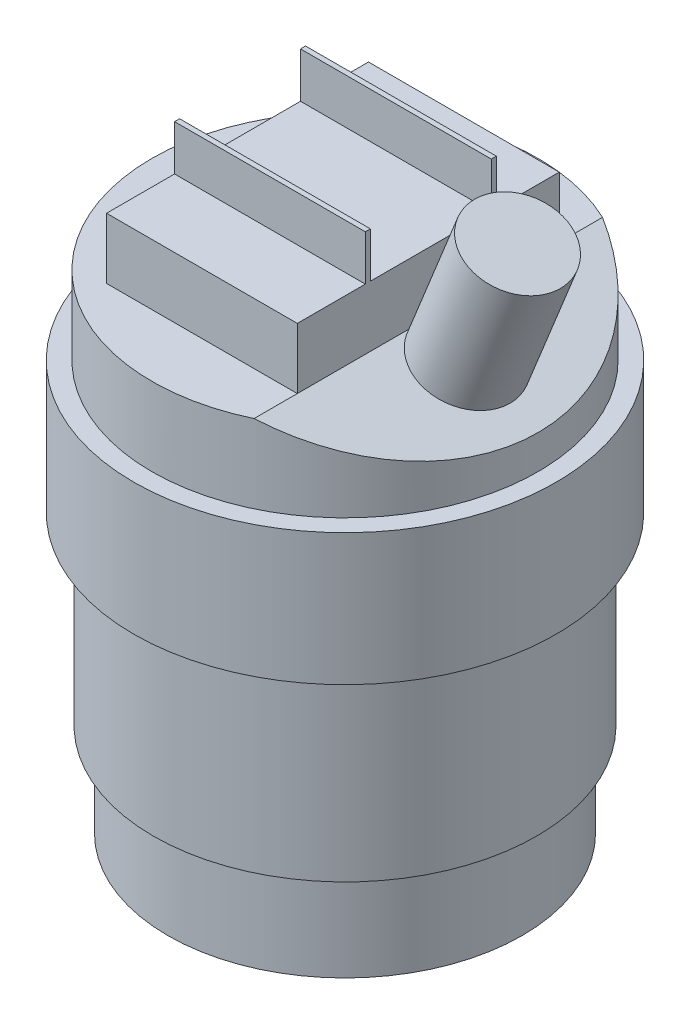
ISO-10303-21;
HEADER;
FILE_DESCRIPTION(('STEP AP214'),'2;1');
FILE_NAME('part.step','',(''),(''),'','','');
FILE_SCHEMA(('AUTOMOTIVE_DESIGN { 1 0 10303 214 1 1 1 1 }'));
ENDSEC;
DATA;
#1=APPLICATION_CONTEXT('core data for automotive mechanical design processes');
#2=APPLICATION_PROTOCOL_DEFINITION('international standard','automotive_design',2000,#1);
#3=PRODUCT_CONTEXT('',#1,'mechanical');
#4=PRODUCT('Part','Part','',(#3));
#5=PRODUCT_RELATED_PRODUCT_CATEGORY('part','',(#4));
#6=PRODUCT_DEFINITION_FORMATION('','',#4);
#7=PRODUCT_DEFINITION_CONTEXT('part definition',#1,'design');
#8=PRODUCT_DEFINITION('design','',#6,#7);
#9=PRODUCT_DEFINITION_SHAPE('','',#8);
#10=(LENGTH_UNIT() NAMED_UNIT(*) SI_UNIT(.MILLI.,.METRE.));
#11=(NAMED_UNIT(*) PLANE_ANGLE_UNIT() SI_UNIT($,.RADIAN.));
#12=(NAMED_UNIT(*) SI_UNIT($,.STERADIAN.) SOLID_ANGLE_UNIT());
#13=UNCERTAINTY_MEASURE_WITH_UNIT(LENGTH_MEASURE(1.E-05),#10,'distance_accuracy_value','');
#14=(GEOMETRIC_REPRESENTATION_CONTEXT(3) GLOBAL_UNCERTAINTY_ASSIGNED_CONTEXT((#13)) GLOBAL_UNIT_ASSIGNED_CONTEXT((#10,
#11,#12)) REPRESENTATION_CONTEXT('',''));
#15=CARTESIAN_POINT('',(0.,0.,0.));
#16=DIRECTION('',(0.,0.,1.));
#17=DIRECTION('',(1.,0.,0.));
#18=AXIS2_PLACEMENT_3D('',#15,#16,#17);
#19=CARTESIAN_POINT('',(6.2992,36.9062,-15.9766));
#20=DIRECTION('',(-0.374606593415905,-0.92718385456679,0.));
#21=DIRECTION('',(0.92718385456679,-0.374606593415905,0.));
#22=AXIS2_PLACEMENT_3D('',#19,#20,#21);
#23=PLANE('',#22);
#24=CARTESIAN_POINT('',(9.24300873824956,35.7168240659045,0.));
#25=DIRECTION('',(0.374606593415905,0.92718385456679,0.));
#26=DIRECTION('',(-0.92718385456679,0.374606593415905,0.));
#27=AXIS2_PLACEMENT_3D('',#24,#25,#26);
#28=CIRCLE('',#27,3.4925);
#29=CARTESIAN_POINT('',(6.2992,36.9062,1.45496778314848));
#30=VERTEX_POINT('',#29);
#31=CARTESIAN_POINT('',(6.2992,36.9062,-1.45496778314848));
#32=VERTEX_POINT('',#31);
#33=EDGE_CURVE('E142',#30,#32,#28,.T.);
#34=ORIENTED_EDGE('',*,*,#33,.F.);
#35=DIRECTION('',(0.,0.,-1.));
#36=VECTOR('',#35,1.);
#37=CARTESIAN_POINT('',(6.2992,36.9062,9.906));
#38=LINE('',#37,#36);
#39=CARTESIAN_POINT('',(6.2992,36.9062,9.906));
#40=VERTEX_POINT('',#39);
#41=EDGE_CURVE('E130',#40,#30,#38,.T.);
#42=ORIENTED_EDGE('',*,*,#41,.F.);
#43=DIRECTION('',(0.,0.,1.));
#44=VECTOR('',#43,1.);
#45=CARTESIAN_POINT('',(6.2992,36.9062,0.));
#46=LINE('',#45,#44);
#47=CARTESIAN_POINT('',(6.2992,36.9062,13.1767258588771));
#48=VERTEX_POINT('',#47);
#49=EDGE_CURVE('E216',#40,#48,#46,.T.);
#50=ORIENTED_EDGE('',*,*,#49,.T.);
#51=CARTESIAN_POINT('',(0.,39.4512420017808,0.));
#52=DIRECTION('',(-0.374606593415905,-0.92718385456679,0.));
#53=DIRECTION('',(0.92718385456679,-0.374606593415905,0.));
#54=AXIS2_PLACEMENT_3D('',#51,#52,#53);
#55=ELLIPSE('',#54,15.7519999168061,14.605);
#56=CARTESIAN_POINT('',(6.2992,36.9062,-13.1767258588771));
#57=VERTEX_POINT('',#56);
#58=EDGE_CURVE('E236',#57,#48,#55,.T.);
#59=ORIENTED_EDGE('',*,*,#58,.F.);
#60=CARTESIAN_POINT('',(6.2992,36.9062,-9.906));
#61=VERTEX_POINT('',#60);
#62=EDGE_CURVE('E39',#57,#61,#46,.T.);
#63=ORIENTED_EDGE('',*,*,#62,.T.);
#64=EDGE_CURVE('E139',#32,#61,#38,.T.);
#65=ORIENTED_EDGE('',*,*,#64,.F.);
#66=EDGE_LOOP('',(#34,#42,#50,#59,#63,#65));
#67=FACE_BOUND('',#66,.T.);
#68=ADVANCED_FACE('F31',(#67),#23,.F.);
#69=CARTESIAN_POINT('',(6.2992,41.5036,9.906));
#70=DIRECTION('',(-1.,0.,0.));
#71=DIRECTION('',(0.,0.,1.));
#72=AXIS2_PLACEMENT_3D('',#69,#70,#71);
#73=PLANE('',#72);
#74=CARTESIAN_POINT('',(6.2992,28.4306417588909,0.));
#75=DIRECTION('',(-1.,0.,0.));
#76=DIRECTION('',(0.,-1.,0.));
#77=AXIS2_PLACEMENT_3D('',#74,#75,#76);
#78=ELLIPSE('',#77,9.32311406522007,3.4925);
#79=EDGE_CURVE('E11',#32,#30,#78,.F.);
#80=ORIENTED_EDGE('',*,*,#79,.F.);
#81=ORIENTED_EDGE('',*,*,#64,.T.);
#82=DIRECTION('',(0.,-1.,0.));
#83=VECTOR('',#82,1.);
#84=CARTESIAN_POINT('',(6.2992,41.5036,-9.906));
#85=LINE('',#84,#83);
#86=CARTESIAN_POINT('',(6.2992,41.5036,-9.906));
#87=VERTEX_POINT('',#86);
#88=EDGE_CURVE('E233',#87,#61,#85,.T.);
#89=ORIENTED_EDGE('',*,*,#88,.F.);
#90=DIRECTION('',(0.,0.,-1.));
#91=VECTOR('',#90,1.);
#92=CARTESIAN_POINT('',(6.2992,41.5036,9.906));
#93=LINE('',#92,#91);
#94=CARTESIAN_POINT('',(6.2992,41.5036,-5.1435));
#95=VERTEX_POINT('',#94);
#96=EDGE_CURVE('E252',#95,#87,#93,.T.);
#97=ORIENTED_EDGE('',*,*,#96,.F.);
#98=DIRECTION('',(0.,-1.,0.));
#99=VECTOR('',#98,1.);
#100=CARTESIAN_POINT('',(6.2992,44.9326,-5.1435));
#101=LINE('',#100,#99);
#102=CARTESIAN_POINT('',(6.2992,44.9326,-5.1435));
#103=VERTEX_POINT('',#102);
#104=EDGE_CURVE('E354',#103,#95,#101,.T.);
#105=ORIENTED_EDGE('',*,*,#104,.F.);
#106=DIRECTION('',(0.,0.,-1.));
#107=VECTOR('',#106,1.);
#108=CARTESIAN_POINT('',(6.2992,44.9326,-4.7625));
#109=LINE('',#108,#107);
#110=CARTESIAN_POINT('',(6.2992,44.9326,-4.7625));
#111=VERTEX_POINT('',#110);
#112=EDGE_CURVE('E359',#111,#103,#109,.T.);
#113=ORIENTED_EDGE('',*,*,#112,.F.);
#114=DIRECTION('',(0.,-1.,0.));
#115=VECTOR('',#114,1.);
#116=CARTESIAN_POINT('',(6.2992,44.9326,-4.7625));
#117=LINE('',#116,#115);
#118=CARTESIAN_POINT('',(6.2992,41.5036,-4.7625));
#119=VERTEX_POINT('',#118);
#120=EDGE_CURVE('E357',#111,#119,#117,.T.);
#121=ORIENTED_EDGE('',*,*,#120,.T.);
#122=CARTESIAN_POINT('',(6.2992,41.5036,4.3815));
#123=VERTEX_POINT('',#122);
#124=EDGE_CURVE('E248',#123,#119,#93,.T.);
#125=ORIENTED_EDGE('',*,*,#124,.F.);
#126=DIRECTION('',(0.,-1.,0.));
#127=VECTOR('',#126,1.);
#128=CARTESIAN_POINT('',(6.2992,44.9326,4.3815));
#129=LINE('',#128,#127);
#130=CARTESIAN_POINT('',(6.2992,44.9326,4.3815));
#131=VERTEX_POINT('',#130);
#132=EDGE_CURVE('E52',#131,#123,#129,.T.);
#133=ORIENTED_EDGE('',*,*,#132,.F.);
#134=DIRECTION('',(0.,0.,-1.));
#135=VECTOR('',#134,1.);
#136=CARTESIAN_POINT('',(6.2992,44.9326,4.3815));
#137=LINE('',#136,#135);
#138=CARTESIAN_POINT('',(6.2992,44.9326,4.7625));
#139=VERTEX_POINT('',#138);
#140=EDGE_CURVE('E393',#139,#131,#137,.T.);
#141=ORIENTED_EDGE('',*,*,#140,.F.);
#142=DIRECTION('',(0.,-1.,0.));
#143=VECTOR('',#142,1.);
#144=CARTESIAN_POINT('',(6.2992,44.9326,4.7625));
#145=LINE('',#144,#143);
#146=CARTESIAN_POINT('',(6.2992,41.5036,4.7625));
#147=VERTEX_POINT('',#146);
#148=EDGE_CURVE('E332',#139,#147,#145,.T.);
#149=ORIENTED_EDGE('',*,*,#148,.T.);
#150=CARTESIAN_POINT('',(6.2992,41.5036,9.906));
#151=VERTEX_POINT('',#150);
#152=EDGE_CURVE('E251',#151,#147,#93,.T.);
#153=ORIENTED_EDGE('',*,*,#152,.F.);
#154=DIRECTION('',(0.,-1.,0.));
#155=VECTOR('',#154,1.);
#156=CARTESIAN_POINT('',(6.2992,41.5036,9.906));
#157=LINE('',#156,#155);
#158=EDGE_CURVE('E135',#151,#40,#157,.T.);
#159=ORIENTED_EDGE('',*,*,#158,.T.);
#160=ORIENTED_EDGE('',*,*,#41,.T.);
#161=EDGE_LOOP('',(#80,#81,#89,#97,#105,#113,#121,#125,#133,#141,#149,#153,#159,#160));
#162=FACE_BOUND('',#161,.T.);
#163=ADVANCED_FACE('F132',(#162),#73,.F.);
#164=CARTESIAN_POINT('',(6.2992,41.5036,-9.906));
#165=DIRECTION('',(0.,1.,0.));
#166=DIRECTION('',(0.,0.,1.));
#167=AXIS2_PLACEMENT_3D('',#164,#165,#166);
#168=PLANE('',#167);
#169=ORIENTED_EDGE('',*,*,#152,.T.);
#170=DIRECTION('',(1.,0.,0.));
#171=VECTOR('',#170,1.);
#172=CARTESIAN_POINT('',(-8.128,41.5036,4.7625));
#173=LINE('',#172,#171);
#174=CARTESIAN_POINT('',(-8.128,41.5036,4.7625));
#175=VERTEX_POINT('',#174);
#176=EDGE_CURVE('E334',#175,#147,#173,.T.);
#177=ORIENTED_EDGE('',*,*,#176,.F.);
#178=DIRECTION('',(0.,0.,1.));
#179=VECTOR('',#178,1.);
#180=CARTESIAN_POINT('',(-8.128,41.5036,9.906));
#181=LINE('',#180,#179);
#182=CARTESIAN_POINT('',(-8.128,41.5036,9.906));
#183=VERTEX_POINT('',#182);
#184=EDGE_CURVE('E253',#175,#183,#181,.T.);
#185=ORIENTED_EDGE('',*,*,#184,.T.);
#186=DIRECTION('',(1.,0.,0.));
#187=VECTOR('',#186,1.);
#188=CARTESIAN_POINT('',(6.2992,41.5036,9.906));
#189=LINE('',#188,#187);
#190=EDGE_CURVE('E271',#183,#151,#189,.T.);
#191=ORIENTED_EDGE('',*,*,#190,.T.);
#192=EDGE_LOOP('',(#169,#177,#185,#191));
#193=FACE_BOUND('',#192,.T.);
#194=ADVANCED_FACE('F168',(#193),#168,.T.);
#195=CARTESIAN_POINT('',(-8.128,41.5036,-4.7625));
#196=VERTEX_POINT('',#195);
#197=CARTESIAN_POINT('',(-8.128,41.5036,4.3815));
#198=VERTEX_POINT('',#197);
#199=EDGE_CURVE('E278',#196,#198,#181,.T.);
#200=ORIENTED_EDGE('',*,*,#199,.T.);
#201=DIRECTION('',(-1.,0.,0.));
#202=VECTOR('',#201,1.);
#203=CARTESIAN_POINT('',(-8.128,41.5036,4.3815));
#204=LINE('',#203,#202);
#205=EDGE_CURVE('E336',#123,#198,#204,.T.);
#206=ORIENTED_EDGE('',*,*,#205,.F.);
#207=ORIENTED_EDGE('',*,*,#124,.T.);
#208=DIRECTION('',(1.,0.,0.));
#209=VECTOR('',#208,1.);
#210=CARTESIAN_POINT('',(-8.128,41.5036,-4.7625));
#211=LINE('',#210,#209);
#212=EDGE_CURVE('E367',#196,#119,#211,.T.);
#213=ORIENTED_EDGE('',*,*,#212,.F.);
#214=EDGE_LOOP('',(#200,#206,#207,#213));
#215=FACE_BOUND('',#214,.T.);
#216=ADVANCED_FACE('F403',(#215),#168,.T.);
#217=DIRECTION('',(-1.,0.,0.));
#218=VECTOR('',#217,1.);
#219=CARTESIAN_POINT('',(-8.128,41.5036,-5.1435));
#220=LINE('',#219,#218);
#221=CARTESIAN_POINT('',(-8.128,41.5036,-5.1435));
#222=VERTEX_POINT('',#221);
#223=EDGE_CURVE('E363',#95,#222,#220,.T.);
#224=ORIENTED_EDGE('',*,*,#223,.F.);
#225=ORIENTED_EDGE('',*,*,#96,.T.);
#226=DIRECTION('',(-1.,0.,0.));
#227=VECTOR('',#226,1.);
#228=CARTESIAN_POINT('',(6.2992,41.5036,-9.906));
#229=LINE('',#228,#227);
#230=CARTESIAN_POINT('',(-8.128,41.5036,-9.906));
#231=VERTEX_POINT('',#230);
#232=EDGE_CURVE('E261',#87,#231,#229,.T.);
#233=ORIENTED_EDGE('',*,*,#232,.T.);
#234=EDGE_CURVE('E274',#231,#222,#181,.T.);
#235=ORIENTED_EDGE('',*,*,#234,.T.);
#236=EDGE_LOOP('',(#224,#225,#233,#235));
#237=FACE_BOUND('',#236,.T.);
#238=ADVANCED_FACE('F185',(#237),#168,.T.);
#239=CARTESIAN_POINT('',(0.,30.988,0.));
#240=DIRECTION('',(0.,1.,0.));
#241=DIRECTION('',(0.,0.,1.));
#242=AXIS2_PLACEMENT_3D('',#239,#240,#241);
#243=PLANE('',#242);
#244=CARTESIAN_POINT('',(0.,30.988,0.));
#245=DIRECTION('',(0.,1.,0.));
#246=DIRECTION('',(0.,0.,1.));
#247=AXIS2_PLACEMENT_3D('',#244,#245,#246);
#248=CIRCLE('',#247,15.9766);
#249=CARTESIAN_POINT('',(0.,30.988,15.9766));
#250=VERTEX_POINT('',#249);
#251=EDGE_CURVE('E295',#250,#250,#248,.T.);
#252=ORIENTED_EDGE('',*,*,#251,.T.);
#253=EDGE_LOOP('',(#252));
#254=FACE_BOUND('',#253,.T.);
#255=CARTESIAN_POINT('',(0.,30.988,0.));
#256=DIRECTION('',(0.,1.,0.));
#257=DIRECTION('',(0.,0.,1.));
#258=AXIS2_PLACEMENT_3D('',#255,#256,#257);
#259=CIRCLE('',#258,14.605);
#260=CARTESIAN_POINT('',(0.,30.988,14.605));
#261=VERTEX_POINT('',#260);
#262=EDGE_CURVE('E288',#261,#261,#259,.T.);
#263=ORIENTED_EDGE('',*,*,#262,.F.);
#264=EDGE_LOOP('',(#263));
#265=FACE_BOUND('',#264,.T.);
#266=ADVANCED_FACE('F182',(#254,#265),#243,.T.);
#267=CARTESIAN_POINT('',(0.,7.0612,0.));
#268=DIRECTION('',(0.,-1.,0.));
#269=DIRECTION('',(0.,0.,-1.));
#270=AXIS2_PLACEMENT_3D('',#267,#268,#269);
#271=CYLINDRICAL_SURFACE('',#270,13.3985);
#272=CARTESIAN_POINT('',(0.,7.0612,0.));
#273=DIRECTION('',(0.,1.,0.));
#274=DIRECTION('',(0.,0.,1.));
#275=AXIS2_PLACEMENT_3D('',#272,#273,#274);
#276=CIRCLE('',#275,13.3985);
#277=CARTESIAN_POINT('',(0.,7.0612,13.3985));
#278=VERTEX_POINT('',#277);
#279=EDGE_CURVE('E212',#278,#278,#276,.T.);
#280=ORIENTED_EDGE('',*,*,#279,.F.);
#281=EDGE_LOOP('',(#280));
#282=FACE_BOUND('',#281,.T.);
#283=CARTESIAN_POINT('',(0.,0.,0.));
#284=DIRECTION('',(0.,1.,0.));
#285=DIRECTION('',(0.,0.,1.));
#286=AXIS2_PLACEMENT_3D('',#283,#284,#285);
#287=CIRCLE('',#286,13.3985);
#288=CARTESIAN_POINT('',(0.,0.,13.3985));
#289=VERTEX_POINT('',#288);
#290=EDGE_CURVE('E210',#289,#289,#287,.T.);
#291=ORIENTED_EDGE('',*,*,#290,.T.);
#292=EDGE_LOOP('',(#291));
#293=FACE_BOUND('',#292,.T.);
#294=ADVANCED_FACE('F33',(#282,#293),#271,.T.);
#295=CARTESIAN_POINT('',(0.,0.,0.));
#296=DIRECTION('',(0.,1.,0.));
#297=DIRECTION('',(0.,0.,1.));
#298=AXIS2_PLACEMENT_3D('',#295,#296,#297);
#299=PLANE('',#298);
#300=ORIENTED_EDGE('',*,*,#290,.F.);
#301=EDGE_LOOP('',(#300));
#302=FACE_BOUND('',#301,.T.);
#303=ADVANCED_FACE('F198',(#302),#299,.F.);
#304=CARTESIAN_POINT('',(0.,7.0612,0.));
#305=DIRECTION('',(0.,1.,0.));
#306=DIRECTION('',(0.,0.,1.));
#307=AXIS2_PLACEMENT_3D('',#304,#305,#306);
#308=PLANE('',#307);
#309=CARTESIAN_POINT('',(0.,7.0612,0.));
#310=DIRECTION('',(0.,1.,0.));
#311=DIRECTION('',(0.,0.,1.));
#312=AXIS2_PLACEMENT_3D('',#309,#310,#311);
#313=CIRCLE('',#312,14.4907);
#314=CARTESIAN_POINT('',(0.,7.0612,14.4907));
#315=VERTEX_POINT('',#314);
#316=EDGE_CURVE('E219',#315,#315,#313,.T.);
#317=ORIENTED_EDGE('',*,*,#316,.F.);
#318=EDGE_LOOP('',(#317));
#319=FACE_BOUND('',#318,.T.);
#320=ORIENTED_EDGE('',*,*,#279,.T.);
#321=EDGE_LOOP('',(#320));
#322=FACE_BOUND('',#321,.T.);
#323=ADVANCED_FACE('F195',(#319,#322),#308,.F.);
#324=CARTESIAN_POINT('',(0.,21.0312,0.));
#325=DIRECTION('',(0.,-1.,0.));
#326=DIRECTION('',(0.,0.,-1.));
#327=AXIS2_PLACEMENT_3D('',#324,#325,#326);
#328=CYLINDRICAL_SURFACE('',#327,14.4907);
#329=CARTESIAN_POINT('',(0.,21.0312,0.));
#330=DIRECTION('',(0.,1.,0.));
#331=DIRECTION('',(0.,0.,1.));
#332=AXIS2_PLACEMENT_3D('',#329,#330,#331);
#333=CIRCLE('',#332,14.4907);
#334=CARTESIAN_POINT('',(0.,21.0312,14.4907));
#335=VERTEX_POINT('',#334);
#336=EDGE_CURVE('E213',#335,#335,#333,.T.);
#337=ORIENTED_EDGE('',*,*,#336,.F.);
#338=EDGE_LOOP('',(#337));
#339=FACE_BOUND('',#338,.T.);
#340=ORIENTED_EDGE('',*,*,#316,.T.);
#341=EDGE_LOOP('',(#340));
#342=FACE_BOUND('',#341,.T.);
#343=ADVANCED_FACE('F190',(#339,#342),#328,.T.);
#344=CARTESIAN_POINT('',(0.,21.0312,0.));
#345=DIRECTION('',(0.,1.,0.));
#346=DIRECTION('',(0.,0.,1.));
#347=AXIS2_PLACEMENT_3D('',#344,#345,#346);
#348=PLANE('',#347);
#349=CARTESIAN_POINT('',(0.,21.0312,0.));
#350=DIRECTION('',(0.,1.,0.));
#351=DIRECTION('',(0.,0.,1.));
#352=AXIS2_PLACEMENT_3D('',#349,#350,#351);
#353=CIRCLE('',#352,15.9766);
#354=CARTESIAN_POINT('',(0.,21.0312,15.9766));
#355=VERTEX_POINT('',#354);
#356=EDGE_CURVE('E292',#355,#355,#353,.T.);
#357=ORIENTED_EDGE('',*,*,#356,.F.);
#358=EDGE_LOOP('',(#357));
#359=FACE_BOUND('',#358,.T.);
#360=ORIENTED_EDGE('',*,*,#336,.T.);
#361=EDGE_LOOP('',(#360));
#362=FACE_BOUND('',#361,.T.);
#363=ADVANCED_FACE('F187',(#359,#362),#348,.F.);
#364=CARTESIAN_POINT('',(0.,30.988,0.));
#365=DIRECTION('',(0.,-1.,0.));
#366=DIRECTION('',(0.,0.,-1.));
#367=AXIS2_PLACEMENT_3D('',#364,#365,#366);
#368=CYLINDRICAL_SURFACE('',#367,15.9766);
#369=ORIENTED_EDGE('',*,*,#251,.F.);
#370=EDGE_LOOP('',(#369));
#371=FACE_BOUND('',#370,.T.);
#372=ORIENTED_EDGE('',*,*,#356,.T.);
#373=EDGE_LOOP('',(#372));
#374=FACE_BOUND('',#373,.T.);
#375=ADVANCED_FACE('F180',(#371,#374),#368,.T.);
#376=CARTESIAN_POINT('',(0.,36.9062,0.));
#377=DIRECTION('',(0.,-1.,0.));
#378=DIRECTION('',(0.,0.,-1.));
#379=AXIS2_PLACEMENT_3D('',#376,#377,#378);
#380=CYLINDRICAL_SURFACE('',#379,14.605);
#381=ORIENTED_EDGE('',*,*,#58,.T.);
#382=CARTESIAN_POINT('',(0.,36.9062,0.));
#383=DIRECTION('',(0.,1.,0.));
#384=DIRECTION('',(0.,0.,1.));
#385=AXIS2_PLACEMENT_3D('',#382,#383,#384);
#386=CIRCLE('',#385,14.605);
#387=EDGE_CURVE('E289',#57,#48,#386,.T.);
#388=ORIENTED_EDGE('',*,*,#387,.F.);
#389=EDGE_LOOP('',(#381,#388));
#390=FACE_BOUND('',#389,.T.);
#391=ORIENTED_EDGE('',*,*,#262,.T.);
#392=EDGE_LOOP('',(#391));
#393=FACE_BOUND('',#392,.T.);
#394=ADVANCED_FACE('F176',(#390,#393),#380,.T.);
#395=CARTESIAN_POINT('',(0.,36.9062,0.));
#396=DIRECTION('',(0.,1.,0.));
#397=DIRECTION('',(0.,0.,1.));
#398=AXIS2_PLACEMENT_3D('',#395,#396,#397);
#399=PLANE('',#398);
#400=DIRECTION('',(1.,0.,0.));
#401=VECTOR('',#400,1.);
#402=CARTESIAN_POINT('',(6.2992,36.9062,9.906));
#403=LINE('',#402,#401);
#404=CARTESIAN_POINT('',(-8.128,36.9062,9.906));
#405=VERTEX_POINT('',#404);
#406=EDGE_CURVE('E242',#405,#40,#403,.T.);
#407=ORIENTED_EDGE('',*,*,#406,.F.);
#408=DIRECTION('',(0.,0.,1.));
#409=VECTOR('',#408,1.);
#410=CARTESIAN_POINT('',(-8.128,36.9062,9.906));
#411=LINE('',#410,#409);
#412=CARTESIAN_POINT('',(-8.128,36.9062,-9.906));
#413=VERTEX_POINT('',#412);
#414=EDGE_CURVE('E230',#413,#405,#411,.T.);
#415=ORIENTED_EDGE('',*,*,#414,.F.);
#416=DIRECTION('',(-1.,0.,0.));
#417=VECTOR('',#416,1.);
#418=CARTESIAN_POINT('',(6.2992,36.9062,-9.906));
#419=LINE('',#418,#417);
#420=EDGE_CURVE('E138',#61,#413,#419,.T.);
#421=ORIENTED_EDGE('',*,*,#420,.F.);
#422=ORIENTED_EDGE('',*,*,#62,.F.);
#423=ORIENTED_EDGE('',*,*,#387,.T.);
#424=ORIENTED_EDGE('',*,*,#49,.F.);
#425=EDGE_LOOP('',(#407,#415,#421,#422,#423,#424));
#426=FACE_BOUND('',#425,.T.);
#427=ADVANCED_FACE('F172',(#426),#399,.T.);
#428=CARTESIAN_POINT('',(6.2992,41.5036,-9.906));
#429=DIRECTION('',(0.,0.,1.));
#430=DIRECTION('',(1.,0.,0.));
#431=AXIS2_PLACEMENT_3D('',#428,#429,#430);
#432=PLANE('',#431);
#433=ORIENTED_EDGE('',*,*,#420,.T.);
#434=DIRECTION('',(0.,-1.,0.));
#435=VECTOR('',#434,1.);
#436=CARTESIAN_POINT('',(-8.128,41.5036,-9.906));
#437=LINE('',#436,#435);
#438=EDGE_CURVE('E237',#231,#413,#437,.T.);
#439=ORIENTED_EDGE('',*,*,#438,.F.);
#440=ORIENTED_EDGE('',*,*,#232,.F.);
#441=ORIENTED_EDGE('',*,*,#88,.T.);
#442=EDGE_LOOP('',(#433,#439,#440,#441));
#443=FACE_BOUND('',#442,.T.);
#444=ADVANCED_FACE('F175',(#443),#432,.F.);
#445=CARTESIAN_POINT('',(-8.128,41.5036,9.906));
#446=DIRECTION('',(1.,0.,0.));
#447=DIRECTION('',(0.,0.,-1.));
#448=AXIS2_PLACEMENT_3D('',#445,#446,#447);
#449=PLANE('',#448);
#450=ORIENTED_EDGE('',*,*,#414,.T.);
#451=DIRECTION('',(0.,-1.,0.));
#452=VECTOR('',#451,1.);
#453=CARTESIAN_POINT('',(-8.128,41.5036,9.906));
#454=LINE('',#453,#452);
#455=EDGE_CURVE('E270',#183,#405,#454,.T.);
#456=ORIENTED_EDGE('',*,*,#455,.F.);
#457=ORIENTED_EDGE('',*,*,#184,.F.);
#458=DIRECTION('',(0.,-1.,0.));
#459=VECTOR('',#458,1.);
#460=CARTESIAN_POINT('',(-8.128,44.9326,4.7625));
#461=LINE('',#460,#459);
#462=CARTESIAN_POINT('',(-8.128,44.9326,4.7625));
#463=VERTEX_POINT('',#462);
#464=EDGE_CURVE('E340',#463,#175,#461,.T.);
#465=ORIENTED_EDGE('',*,*,#464,.F.);
#466=DIRECTION('',(0.,0.,1.));
#467=VECTOR('',#466,1.);
#468=CARTESIAN_POINT('',(-8.128,44.9326,4.3815));
#469=LINE('',#468,#467);
#470=CARTESIAN_POINT('',(-8.128,44.9326,4.3815));
#471=VERTEX_POINT('',#470);
#472=EDGE_CURVE('E390',#471,#463,#469,.T.);
#473=ORIENTED_EDGE('',*,*,#472,.F.);
#474=DIRECTION('',(0.,-1.,0.));
#475=VECTOR('',#474,1.);
#476=CARTESIAN_POINT('',(-8.128,44.9326,4.3815));
#477=LINE('',#476,#475);
#478=EDGE_CURVE('E386',#471,#198,#477,.T.);
#479=ORIENTED_EDGE('',*,*,#478,.T.);
#480=ORIENTED_EDGE('',*,*,#199,.F.);
#481=DIRECTION('',(0.,-1.,0.));
#482=VECTOR('',#481,1.);
#483=CARTESIAN_POINT('',(-8.128,44.9326,-4.7625));
#484=LINE('',#483,#482);
#485=CARTESIAN_POINT('',(-8.128,44.9326,-4.7625));
#486=VERTEX_POINT('',#485);
#487=EDGE_CURVE('E247',#486,#196,#484,.T.);
#488=ORIENTED_EDGE('',*,*,#487,.F.);
#489=DIRECTION('',(0.,0.,1.));
#490=VECTOR('',#489,1.);
#491=CARTESIAN_POINT('',(-8.128,44.9326,-4.7625));
#492=LINE('',#491,#490);
#493=CARTESIAN_POINT('',(-8.128,44.9326,-5.1435));
#494=VERTEX_POINT('',#493);
#495=EDGE_CURVE('E351',#494,#486,#492,.T.);
#496=ORIENTED_EDGE('',*,*,#495,.F.);
#497=DIRECTION('',(0.,-1.,0.));
#498=VECTOR('',#497,1.);
#499=CARTESIAN_POINT('',(-8.128,44.9326,-5.1435));
#500=LINE('',#499,#498);
#501=EDGE_CURVE('E348',#494,#222,#500,.T.);
#502=ORIENTED_EDGE('',*,*,#501,.T.);
#503=ORIENTED_EDGE('',*,*,#234,.F.);
#504=ORIENTED_EDGE('',*,*,#438,.T.);
#505=EDGE_LOOP('',(#450,#456,#457,#465,#473,#479,#480,#488,#496,#502,#503,#504));
#506=FACE_BOUND('',#505,.T.);
#507=ADVANCED_FACE('F324',(#506),#449,.F.);
#508=CARTESIAN_POINT('',(6.2992,41.5036,9.906));
#509=DIRECTION('',(0.,0.,-1.));
#510=DIRECTION('',(-1.,0.,0.));
#511=AXIS2_PLACEMENT_3D('',#508,#509,#510);
#512=PLANE('',#511);
#513=ORIENTED_EDGE('',*,*,#406,.T.);
#514=ORIENTED_EDGE('',*,*,#158,.F.);
#515=ORIENTED_EDGE('',*,*,#190,.F.);
#516=ORIENTED_EDGE('',*,*,#455,.T.);
#517=EDGE_LOOP('',(#513,#514,#515,#516));
#518=FACE_BOUND('',#517,.T.);
#519=ADVANCED_FACE('F328',(#518),#512,.F.);
#520=CARTESIAN_POINT('',(-8.128,44.9326,-4.7625));
#521=DIRECTION('',(0.,0.,-1.));
#522=DIRECTION('',(-1.,0.,0.));
#523=AXIS2_PLACEMENT_3D('',#520,#521,#522);
#524=PLANE('',#523);
#525=ORIENTED_EDGE('',*,*,#212,.T.);
#526=ORIENTED_EDGE('',*,*,#120,.F.);
#527=DIRECTION('',(1.,0.,0.));
#528=VECTOR('',#527,1.);
#529=CARTESIAN_POINT('',(-8.128,44.9326,-4.7625));
#530=LINE('',#529,#528);
#531=EDGE_CURVE('E380',#486,#111,#530,.T.);
#532=ORIENTED_EDGE('',*,*,#531,.F.);
#533=ORIENTED_EDGE('',*,*,#487,.T.);
#534=EDGE_LOOP('',(#525,#526,#532,#533));
#535=FACE_BOUND('',#534,.T.);
#536=ADVANCED_FACE('F407',(#535),#524,.F.);
#537=CARTESIAN_POINT('',(-8.128,44.9326,-5.1435));
#538=DIRECTION('',(0.,0.,1.));
#539=DIRECTION('',(1.,0.,0.));
#540=AXIS2_PLACEMENT_3D('',#537,#538,#539);
#541=PLANE('',#540);
#542=ORIENTED_EDGE('',*,*,#223,.T.);
#543=ORIENTED_EDGE('',*,*,#501,.F.);
#544=DIRECTION('',(-1.,0.,0.));
#545=VECTOR('',#544,1.);
#546=CARTESIAN_POINT('',(-8.128,44.9326,-5.1435));
#547=LINE('',#546,#545);
#548=EDGE_CURVE('E355',#103,#494,#547,.T.);
#549=ORIENTED_EDGE('',*,*,#548,.F.);
#550=ORIENTED_EDGE('',*,*,#104,.T.);
#551=EDGE_LOOP('',(#542,#543,#549,#550));
#552=FACE_BOUND('',#551,.T.);
#553=ADVANCED_FACE('F411',(#552),#541,.F.);
#554=CARTESIAN_POINT('',(-8.128,44.9326,-5.1435));
#555=DIRECTION('',(0.,-1.,0.));
#556=DIRECTION('',(0.,0.,-1.));
#557=AXIS2_PLACEMENT_3D('',#554,#555,#556);
#558=PLANE('',#557);
#559=ORIENTED_EDGE('',*,*,#495,.T.);
#560=ORIENTED_EDGE('',*,*,#531,.T.);
#561=ORIENTED_EDGE('',*,*,#112,.T.);
#562=ORIENTED_EDGE('',*,*,#548,.T.);
#563=EDGE_LOOP('',(#559,#560,#561,#562));
#564=FACE_BOUND('',#563,.T.);
#565=ADVANCED_FACE('F410',(#564),#558,.F.);
#566=CARTESIAN_POINT('',(-8.128,44.9326,4.7625));
#567=DIRECTION('',(0.,0.,-1.));
#568=DIRECTION('',(-1.,0.,0.));
#569=AXIS2_PLACEMENT_3D('',#566,#567,#568);
#570=PLANE('',#569);
#571=ORIENTED_EDGE('',*,*,#176,.T.);
#572=ORIENTED_EDGE('',*,*,#148,.F.);
#573=DIRECTION('',(1.,0.,0.));
#574=VECTOR('',#573,1.);
#575=CARTESIAN_POINT('',(-8.128,44.9326,4.7625));
#576=LINE('',#575,#574);
#577=EDGE_CURVE('E395',#463,#139,#576,.T.);
#578=ORIENTED_EDGE('',*,*,#577,.F.);
#579=ORIENTED_EDGE('',*,*,#464,.T.);
#580=EDGE_LOOP('',(#571,#572,#578,#579));
#581=FACE_BOUND('',#580,.T.);
#582=ADVANCED_FACE('F418',(#581),#570,.F.);
#583=CARTESIAN_POINT('',(-8.128,44.9326,4.3815));
#584=DIRECTION('',(0.,0.,1.));
#585=DIRECTION('',(1.,0.,0.));
#586=AXIS2_PLACEMENT_3D('',#583,#584,#585);
#587=PLANE('',#586);
#588=ORIENTED_EDGE('',*,*,#205,.T.);
#589=ORIENTED_EDGE('',*,*,#478,.F.);
#590=DIRECTION('',(-1.,0.,0.));
#591=VECTOR('',#590,1.);
#592=CARTESIAN_POINT('',(-8.128,44.9326,4.3815));
#593=LINE('',#592,#591);
#594=EDGE_CURVE('E389',#131,#471,#593,.T.);
#595=ORIENTED_EDGE('',*,*,#594,.F.);
#596=ORIENTED_EDGE('',*,*,#132,.T.);
#597=EDGE_LOOP('',(#588,#589,#595,#596));
#598=FACE_BOUND('',#597,.T.);
#599=ADVANCED_FACE('F159',(#598),#587,.F.);
#600=CARTESIAN_POINT('',(-8.128,44.9326,4.7625));
#601=DIRECTION('',(0.,1.,0.));
#602=DIRECTION('',(0.,0.,1.));
#603=AXIS2_PLACEMENT_3D('',#600,#601,#602);
#604=PLANE('',#603);
#605=ORIENTED_EDGE('',*,*,#472,.T.);
#606=ORIENTED_EDGE('',*,*,#577,.T.);
#607=ORIENTED_EDGE('',*,*,#140,.T.);
#608=ORIENTED_EDGE('',*,*,#594,.T.);
#609=EDGE_LOOP('',(#605,#606,#607,#608));
#610=FACE_BOUND('',#609,.T.);
#611=ADVANCED_FACE('F150',(#610),#604,.T.);
#612=CARTESIAN_POINT('',(13.0490117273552,45.1370120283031,0.));
#613=DIRECTION('',(-0.374606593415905,-0.92718385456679,0.));
#614=DIRECTION('',(0.92718385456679,-0.374606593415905,0.));
#615=AXIS2_PLACEMENT_3D('',#612,#613,#614);
#616=CYLINDRICAL_SURFACE('',#615,3.4925);
#617=CARTESIAN_POINT('',(13.0490117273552,45.1370120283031,0.));
#618=DIRECTION('',(0.374606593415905,0.92718385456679,0.));
#619=DIRECTION('',(-0.92718385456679,0.374606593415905,0.));
#620=AXIS2_PLACEMENT_3D('',#617,#618,#619);
#621=CIRCLE('',#620,3.4925);
#622=CARTESIAN_POINT('',(9.81082211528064,46.4453255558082,0.));
#623=VERTEX_POINT('',#622);
#624=EDGE_CURVE('E145',#623,#623,#621,.T.);
#625=ORIENTED_EDGE('',*,*,#624,.F.);
#626=EDGE_LOOP('',(#625));
#627=FACE_BOUND('',#626,.T.);
#628=ORIENTED_EDGE('',*,*,#33,.T.);
#629=ORIENTED_EDGE('',*,*,#79,.T.);
#630=EDGE_LOOP('',(#628,#629));
#631=FACE_BOUND('',#630,.T.);
#632=ADVANCED_FACE('F147',(#627,#631),#616,.T.);
#633=CARTESIAN_POINT('',(13.0490117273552,45.1370120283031,0.));
#634=DIRECTION('',(0.374606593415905,0.92718385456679,0.));
#635=DIRECTION('',(-0.92718385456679,0.374606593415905,0.));
#636=AXIS2_PLACEMENT_3D('',#633,#634,#635);
#637=PLANE('',#636);
#638=ORIENTED_EDGE('',*,*,#624,.T.);
#639=EDGE_LOOP('',(#638));
#640=FACE_BOUND('',#639,.T.);
#641=ADVANCED_FACE('F149',(#640),#637,.T.);
#642=CLOSED_SHELL('',(#68,#163,#194,#216,#238,#266,#294,#303,#323,#343,#363,#375,#394,#427,#444,
#507,#519,#536,#553,#565,#582,#599,#611,#632,#641));
#643=MANIFOLD_SOLID_BREP('B2',#642);
#644=ADVANCED_BREP_SHAPE_REPRESENTATION('',(#18,#643),#14);
#645=SHAPE_DEFINITION_REPRESENTATION(#9,#644);
ENDSEC;
END-ISO-10303-21;
